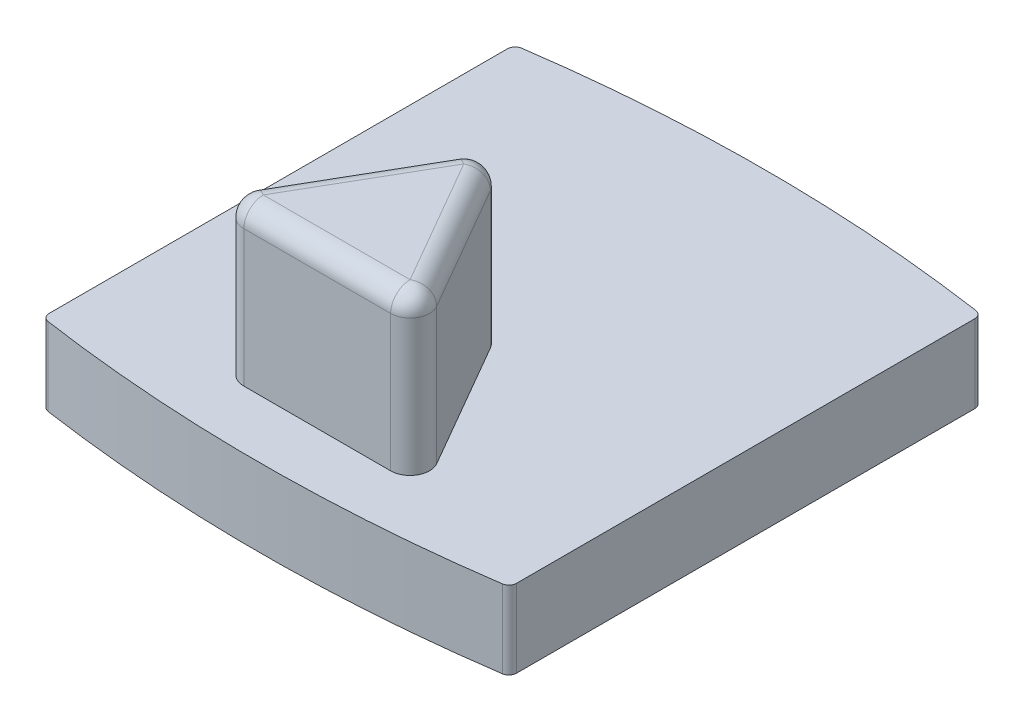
ISO-10303-21;
HEADER;
FILE_DESCRIPTION(('STEP AP214'),'2;1');
FILE_NAME('part.step','',(''),(''),'','','');
FILE_SCHEMA(('AUTOMOTIVE_DESIGN { 1 0 10303 214 1 1 1 1 }'));
ENDSEC;
DATA;
#1=APPLICATION_CONTEXT('core data for automotive mechanical design processes');
#2=APPLICATION_PROTOCOL_DEFINITION('international standard','automotive_design',2000,#1);
#3=PRODUCT_CONTEXT('',#1,'mechanical');
#4=PRODUCT('Part','Part','',(#3));
#5=PRODUCT_RELATED_PRODUCT_CATEGORY('part','',(#4));
#6=PRODUCT_DEFINITION_FORMATION('','',#4);
#7=PRODUCT_DEFINITION_CONTEXT('part definition',#1,'design');
#8=PRODUCT_DEFINITION('design','',#6,#7);
#9=PRODUCT_DEFINITION_SHAPE('','',#8);
#10=(LENGTH_UNIT() NAMED_UNIT(*) SI_UNIT(.MILLI.,.METRE.));
#11=(NAMED_UNIT(*) PLANE_ANGLE_UNIT() SI_UNIT($,.RADIAN.));
#12=(NAMED_UNIT(*) SI_UNIT($,.STERADIAN.) SOLID_ANGLE_UNIT());
#13=UNCERTAINTY_MEASURE_WITH_UNIT(LENGTH_MEASURE(1.E-05),#10,'distance_accuracy_value','');
#14=(GEOMETRIC_REPRESENTATION_CONTEXT(3) GLOBAL_UNCERTAINTY_ASSIGNED_CONTEXT((#13)) GLOBAL_UNIT_ASSIGNED_CONTEXT((#10,
#11,#12)) REPRESENTATION_CONTEXT('',''));
#15=CARTESIAN_POINT('',(0.,0.,0.));
#16=DIRECTION('',(0.,0.,1.));
#17=DIRECTION('',(1.,0.,0.));
#18=AXIS2_PLACEMENT_3D('',#15,#16,#17);
#19=CARTESIAN_POINT('',(0.,2.,0.));
#20=DIRECTION('',(0.,-1.,0.));
#21=DIRECTION('',(0.,0.,-1.));
#22=AXIS2_PLACEMENT_3D('',#19,#20,#21);
#23=PLANE('',#22);
#24=CARTESIAN_POINT('',(0.,2.,-34.));
#25=DIRECTION('',(0.,1.,0.));
#26=DIRECTION('',(0.,0.,1.));
#27=AXIS2_PLACEMENT_3D('',#24,#25,#26);
#28=CIRCLE('',#27,40.5);
#29=CARTESIAN_POINT('',(5.8287841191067,2.,6.07836418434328));
#30=VERTEX_POINT('',#29);
#31=CARTESIAN_POINT('',(-5.8287841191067,2.,6.07836418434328));
#32=VERTEX_POINT('',#31);
#33=EDGE_CURVE('E205',#30,#32,#28,.F.);
#34=ORIENTED_EDGE('',*,*,#33,.F.);
#35=CARTESIAN_POINT('',(5.8,2.,5.88044633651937));
#36=DIRECTION('',(0.,-1.,0.));
#37=DIRECTION('',(0.,0.,-1.));
#38=AXIS2_PLACEMENT_3D('',#35,#36,#37);
#39=CIRCLE('',#38,0.2);
#40=CARTESIAN_POINT('',(6.,2.,5.88044633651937));
#41=VERTEX_POINT('',#40);
#42=EDGE_CURVE('E329',#30,#41,#39,.F.);
#43=ORIENTED_EDGE('',*,*,#42,.T.);
#44=DIRECTION('',(0.,0.,-1.));
#45=VECTOR('',#44,1.);
#46=CARTESIAN_POINT('',(6.,2.,6.5));
#47=LINE('',#46,#45);
#48=CARTESIAN_POINT('',(6.,2.,-5.88044633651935));
#49=VERTEX_POINT('',#48);
#50=EDGE_CURVE('E217',#41,#49,#47,.T.);
#51=ORIENTED_EDGE('',*,*,#50,.T.);
#52=CARTESIAN_POINT('',(5.8,2.,-5.88044633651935));
#53=DIRECTION('',(0.,-1.,0.));
#54=DIRECTION('',(0.,0.,-1.));
#55=AXIS2_PLACEMENT_3D('',#52,#53,#54);
#56=CIRCLE('',#55,0.2);
#57=CARTESIAN_POINT('',(5.8287841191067,2.,-6.07836418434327));
#58=VERTEX_POINT('',#57);
#59=EDGE_CURVE('E71',#49,#58,#56,.F.);
#60=ORIENTED_EDGE('',*,*,#59,.T.);
#61=CARTESIAN_POINT('',(0.,2.,34.));
#62=DIRECTION('',(0.,1.,0.));
#63=DIRECTION('',(0.,0.,1.));
#64=AXIS2_PLACEMENT_3D('',#61,#62,#63);
#65=CIRCLE('',#64,40.5);
#66=CARTESIAN_POINT('',(-5.8287841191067,2.,-6.07836418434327));
#67=VERTEX_POINT('',#66);
#68=EDGE_CURVE('E213',#58,#67,#65,.T.);
#69=ORIENTED_EDGE('',*,*,#68,.T.);
#70=CARTESIAN_POINT('',(-5.8,2.,-5.88044633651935));
#71=DIRECTION('',(0.,-1.,0.));
#72=DIRECTION('',(0.,0.,-1.));
#73=AXIS2_PLACEMENT_3D('',#70,#71,#72);
#74=CIRCLE('',#73,0.2);
#75=CARTESIAN_POINT('',(-6.,2.,-5.88044633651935));
#76=VERTEX_POINT('',#75);
#77=EDGE_CURVE('E63',#67,#76,#74,.F.);
#78=ORIENTED_EDGE('',*,*,#77,.T.);
#79=DIRECTION('',(0.,0.,1.));
#80=VECTOR('',#79,1.);
#81=CARTESIAN_POINT('',(-6.,2.,6.5));
#82=LINE('',#81,#80);
#83=CARTESIAN_POINT('',(-6.,2.,5.88044633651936));
#84=VERTEX_POINT('',#83);
#85=EDGE_CURVE('E220',#76,#84,#82,.T.);
#86=ORIENTED_EDGE('',*,*,#85,.T.);
#87=CARTESIAN_POINT('',(-5.8,2.,5.88044633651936));
#88=DIRECTION('',(0.,-1.,0.));
#89=DIRECTION('',(0.,0.,-1.));
#90=AXIS2_PLACEMENT_3D('',#87,#88,#89);
#91=CIRCLE('',#90,0.2);
#92=EDGE_CURVE('E326',#84,#32,#91,.F.);
#93=ORIENTED_EDGE('',*,*,#92,.T.);
#94=EDGE_LOOP('',(#34,#43,#51,#60,#69,#78,#86,#93));
#95=FACE_BOUND('',#94,.T.);
#96=DIRECTION('',(-0.500000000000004,0.,0.866025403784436));
#97=VECTOR('',#96,1.);
#98=CARTESIAN_POINT('',(0.,2.,0.23686027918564));
#99=LINE('',#98,#97);
#100=CARTESIAN_POINT('',(-0.433012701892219,2.,0.98686027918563));
#101=VERTEX_POINT('',#100);
#102=CARTESIAN_POINT('',(-2.31698729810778,2.,4.25));
#103=VERTEX_POINT('',#102);
#104=EDGE_CURVE('E166',#101,#103,#99,.T.);
#105=ORIENTED_EDGE('',*,*,#104,.F.);
#106=CARTESIAN_POINT('',(0.,2.,1.23686027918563));
#107=DIRECTION('',(0.,-1.,0.));
#108=DIRECTION('',(0.,0.,-1.));
#109=AXIS2_PLACEMENT_3D('',#106,#107,#108);
#110=CIRCLE('',#109,0.5);
#111=CARTESIAN_POINT('',(0.433012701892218,2.,0.98686027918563));
#112=VERTEX_POINT('',#111);
#113=EDGE_CURVE('E177',#101,#112,#110,.T.);
#114=ORIENTED_EDGE('',*,*,#113,.T.);
#115=DIRECTION('',(-0.500000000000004,0.,-0.866025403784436));
#116=VECTOR('',#115,1.);
#117=CARTESIAN_POINT('',(2.75,2.,5.));
#118=LINE('',#117,#116);
#119=CARTESIAN_POINT('',(2.31698729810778,2.,4.25));
#120=VERTEX_POINT('',#119);
#121=EDGE_CURVE('E197',#120,#112,#118,.T.);
#122=ORIENTED_EDGE('',*,*,#121,.F.);
#123=CARTESIAN_POINT('',(1.88397459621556,2.,4.5));
#124=DIRECTION('',(0.,-1.,0.));
#125=DIRECTION('',(0.,0.,-1.));
#126=AXIS2_PLACEMENT_3D('',#123,#124,#125);
#127=CIRCLE('',#126,0.5);
#128=CARTESIAN_POINT('',(1.88397459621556,2.,5.));
#129=VERTEX_POINT('',#128);
#130=EDGE_CURVE('E249',#120,#129,#127,.T.);
#131=ORIENTED_EDGE('',*,*,#130,.T.);
#132=DIRECTION('',(1.,0.,0.));
#133=VECTOR('',#132,1.);
#134=CARTESIAN_POINT('',(-2.75,2.,5.));
#135=LINE('',#134,#133);
#136=CARTESIAN_POINT('',(-1.88397459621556,2.,5.));
#137=VERTEX_POINT('',#136);
#138=EDGE_CURVE('E191',#137,#129,#135,.T.);
#139=ORIENTED_EDGE('',*,*,#138,.F.);
#140=CARTESIAN_POINT('',(-1.88397459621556,2.,4.5));
#141=DIRECTION('',(0.,-1.,0.));
#142=DIRECTION('',(0.,0.,-1.));
#143=AXIS2_PLACEMENT_3D('',#140,#141,#142);
#144=CIRCLE('',#143,0.5);
#145=EDGE_CURVE('E185',#137,#103,#144,.T.);
#146=ORIENTED_EDGE('',*,*,#145,.T.);
#147=EDGE_LOOP('',(#105,#114,#122,#131,#139,#146));
#148=FACE_BOUND('',#147,.T.);
#149=ADVANCED_FACE('F47',(#95,#148),#23,.F.);
#150=CARTESIAN_POINT('',(0.,0.,0.));
#151=DIRECTION('',(0.,-1.,0.));
#152=DIRECTION('',(0.,0.,-1.));
#153=AXIS2_PLACEMENT_3D('',#150,#151,#152);
#154=PLANE('',#153);
#155=DIRECTION('',(0.,0.,-1.));
#156=VECTOR('',#155,1.);
#157=CARTESIAN_POINT('',(6.,0.,6.5));
#158=LINE('',#157,#156);
#159=CARTESIAN_POINT('',(6.,0.,5.88044633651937));
#160=VERTEX_POINT('',#159);
#161=CARTESIAN_POINT('',(6.,0.,-5.88044633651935));
#162=VERTEX_POINT('',#161);
#163=EDGE_CURVE('E216',#160,#162,#158,.T.);
#164=ORIENTED_EDGE('',*,*,#163,.F.);
#165=CARTESIAN_POINT('',(5.8,0.,5.88044633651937));
#166=DIRECTION('',(0.,-1.,0.));
#167=DIRECTION('',(0.,0.,-1.));
#168=AXIS2_PLACEMENT_3D('',#165,#166,#167);
#169=CIRCLE('',#168,0.2);
#170=CARTESIAN_POINT('',(5.8287841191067,0.,6.07836418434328));
#171=VERTEX_POINT('',#170);
#172=EDGE_CURVE('E313',#160,#171,#169,.T.);
#173=ORIENTED_EDGE('',*,*,#172,.T.);
#174=CARTESIAN_POINT('',(0.,0.,-34.));
#175=DIRECTION('',(0.,-1.,0.));
#176=DIRECTION('',(0.,0.,-1.));
#177=AXIS2_PLACEMENT_3D('',#174,#175,#176);
#178=CIRCLE('',#177,40.5);
#179=CARTESIAN_POINT('',(-5.8287841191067,0.,6.07836418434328));
#180=VERTEX_POINT('',#179);
#181=EDGE_CURVE('E209',#180,#171,#178,.F.);
#182=ORIENTED_EDGE('',*,*,#181,.F.);
#183=CARTESIAN_POINT('',(-5.8,0.,5.88044633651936));
#184=DIRECTION('',(0.,-1.,0.));
#185=DIRECTION('',(0.,0.,-1.));
#186=AXIS2_PLACEMENT_3D('',#183,#184,#185);
#187=CIRCLE('',#186,0.2);
#188=CARTESIAN_POINT('',(-6.,0.,5.88044633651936));
#189=VERTEX_POINT('',#188);
#190=EDGE_CURVE('E310',#180,#189,#187,.T.);
#191=ORIENTED_EDGE('',*,*,#190,.T.);
#192=DIRECTION('',(0.,0.,1.));
#193=VECTOR('',#192,1.);
#194=CARTESIAN_POINT('',(-6.,0.,6.5));
#195=LINE('',#194,#193);
#196=CARTESIAN_POINT('',(-6.,0.,-5.88044633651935));
#197=VERTEX_POINT('',#196);
#198=EDGE_CURVE('E221',#197,#189,#195,.T.);
#199=ORIENTED_EDGE('',*,*,#198,.F.);
#200=CARTESIAN_POINT('',(-5.8,0.,-5.88044633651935));
#201=DIRECTION('',(0.,-1.,0.));
#202=DIRECTION('',(0.,0.,-1.));
#203=AXIS2_PLACEMENT_3D('',#200,#201,#202);
#204=CIRCLE('',#203,0.2);
#205=CARTESIAN_POINT('',(-5.8287841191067,0.,-6.07836418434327));
#206=VERTEX_POINT('',#205);
#207=EDGE_CURVE('E304',#197,#206,#204,.T.);
#208=ORIENTED_EDGE('',*,*,#207,.T.);
#209=CARTESIAN_POINT('',(0.,0.,34.));
#210=DIRECTION('',(0.,-1.,0.));
#211=DIRECTION('',(0.,0.,-1.));
#212=AXIS2_PLACEMENT_3D('',#209,#210,#211);
#213=CIRCLE('',#212,40.5);
#214=CARTESIAN_POINT('',(5.8287841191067,0.,-6.07836418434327));
#215=VERTEX_POINT('',#214);
#216=EDGE_CURVE('E225',#206,#215,#213,.T.);
#217=ORIENTED_EDGE('',*,*,#216,.T.);
#218=CARTESIAN_POINT('',(5.8,0.,-5.88044633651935));
#219=DIRECTION('',(0.,-1.,0.));
#220=DIRECTION('',(0.,0.,-1.));
#221=AXIS2_PLACEMENT_3D('',#218,#219,#220);
#222=CIRCLE('',#221,0.2);
#223=EDGE_CURVE('E307',#215,#162,#222,.T.);
#224=ORIENTED_EDGE('',*,*,#223,.T.);
#225=EDGE_LOOP('',(#164,#173,#182,#191,#199,#208,#217,#224));
#226=FACE_BOUND('',#225,.T.);
#227=ADVANCED_FACE('F352',(#226),#154,.T.);
#228=CARTESIAN_POINT('',(6.,2.,6.5));
#229=DIRECTION('',(-1.,0.,0.));
#230=DIRECTION('',(0.,0.,1.));
#231=AXIS2_PLACEMENT_3D('',#228,#229,#230);
#232=PLANE('',#231);
#233=ORIENTED_EDGE('',*,*,#50,.F.);
#234=DIRECTION('',(0.,1.,0.));
#235=VECTOR('',#234,1.);
#236=CARTESIAN_POINT('',(6.,2.,5.88044633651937));
#237=LINE('',#236,#235);
#238=EDGE_CURVE('E300',#41,#160,#237,.F.);
#239=ORIENTED_EDGE('',*,*,#238,.T.);
#240=ORIENTED_EDGE('',*,*,#163,.T.);
#241=DIRECTION('',(0.,-1.,0.));
#242=VECTOR('',#241,1.);
#243=CARTESIAN_POINT('',(6.,2.,-5.88044633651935));
#244=LINE('',#243,#242);
#245=EDGE_CURVE('E280',#162,#49,#244,.F.);
#246=ORIENTED_EDGE('',*,*,#245,.T.);
#247=EDGE_LOOP('',(#233,#239,#240,#246));
#248=FACE_BOUND('',#247,.T.);
#249=ADVANCED_FACE('F367',(#248),#232,.F.);
#250=CARTESIAN_POINT('',(-6.,2.,6.5));
#251=DIRECTION('',(1.,0.,0.));
#252=DIRECTION('',(0.,0.,-1.));
#253=AXIS2_PLACEMENT_3D('',#250,#251,#252);
#254=PLANE('',#253);
#255=ORIENTED_EDGE('',*,*,#198,.T.);
#256=DIRECTION('',(0.,1.,0.));
#257=VECTOR('',#256,1.);
#258=CARTESIAN_POINT('',(-6.,2.,5.88044633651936));
#259=LINE('',#258,#257);
#260=EDGE_CURVE('E335',#189,#84,#259,.T.);
#261=ORIENTED_EDGE('',*,*,#260,.T.);
#262=ORIENTED_EDGE('',*,*,#85,.F.);
#263=DIRECTION('',(0.,-1.,0.));
#264=VECTOR('',#263,1.);
#265=CARTESIAN_POINT('',(-6.,0.,-5.88044633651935));
#266=LINE('',#265,#264);
#267=EDGE_CURVE('E332',#76,#197,#266,.T.);
#268=ORIENTED_EDGE('',*,*,#267,.T.);
#269=EDGE_LOOP('',(#255,#261,#262,#268));
#270=FACE_BOUND('',#269,.T.);
#271=ADVANCED_FACE('F347',(#270),#254,.F.);
#272=CARTESIAN_POINT('',(0.,-8.,34.));
#273=DIRECTION('',(0.,1.,0.));
#274=DIRECTION('',(0.,0.,1.));
#275=AXIS2_PLACEMENT_3D('',#272,#273,#274);
#276=CYLINDRICAL_SURFACE('',#275,40.5);
#277=ORIENTED_EDGE('',*,*,#68,.F.);
#278=DIRECTION('',(0.,1.,0.));
#279=VECTOR('',#278,1.);
#280=CARTESIAN_POINT('',(5.8287841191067,-8.,-6.07836418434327));
#281=LINE('',#280,#279);
#282=EDGE_CURVE('E11',#58,#215,#281,.F.);
#283=ORIENTED_EDGE('',*,*,#282,.T.);
#284=ORIENTED_EDGE('',*,*,#216,.F.);
#285=DIRECTION('',(0.,1.,0.));
#286=VECTOR('',#285,1.);
#287=CARTESIAN_POINT('',(-5.8287841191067,-8.,-6.07836418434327));
#288=LINE('',#287,#286);
#289=EDGE_CURVE('E56',#206,#67,#288,.T.);
#290=ORIENTED_EDGE('',*,*,#289,.T.);
#291=EDGE_LOOP('',(#277,#283,#284,#290));
#292=FACE_BOUND('',#291,.T.);
#293=ADVANCED_FACE('F341',(#292),#276,.T.);
#294=CARTESIAN_POINT('',(0.,-8.,-34.));
#295=DIRECTION('',(0.,1.,0.));
#296=DIRECTION('',(0.,0.,1.));
#297=AXIS2_PLACEMENT_3D('',#294,#295,#296);
#298=CYLINDRICAL_SURFACE('',#297,40.5);
#299=ORIENTED_EDGE('',*,*,#181,.T.);
#300=DIRECTION('',(0.,1.,0.));
#301=VECTOR('',#300,1.);
#302=CARTESIAN_POINT('',(5.8287841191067,-8.,6.07836418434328));
#303=LINE('',#302,#301);
#304=EDGE_CURVE('E319',#171,#30,#303,.T.);
#305=ORIENTED_EDGE('',*,*,#304,.T.);
#306=ORIENTED_EDGE('',*,*,#33,.T.);
#307=DIRECTION('',(0.,1.,0.));
#308=VECTOR('',#307,1.);
#309=CARTESIAN_POINT('',(-5.8287841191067,-8.,6.07836418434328));
#310=LINE('',#309,#308);
#311=EDGE_CURVE('E316',#32,#180,#310,.F.);
#312=ORIENTED_EDGE('',*,*,#311,.T.);
#313=EDGE_LOOP('',(#299,#305,#306,#312));
#314=FACE_BOUND('',#313,.T.);
#315=ADVANCED_FACE('F360',(#314),#298,.T.);
#316=CARTESIAN_POINT('',(0.,6.,0.23686027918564));
#317=DIRECTION('',(0.866025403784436,0.,0.500000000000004));
#318=DIRECTION('',(0.500000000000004,0.,-0.866025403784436));
#319=AXIS2_PLACEMENT_3D('',#316,#317,#318);
#320=PLANE('',#319);
#321=DIRECTION('',(0.,-1.,0.));
#322=VECTOR('',#321,1.);
#323=CARTESIAN_POINT('',(-2.31698729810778,6.,4.25));
#324=LINE('',#323,#322);
#325=CARTESIAN_POINT('',(-2.31698729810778,5.5,4.25));
#326=VERTEX_POINT('',#325);
#327=EDGE_CURVE('E174',#103,#326,#324,.F.);
#328=ORIENTED_EDGE('',*,*,#327,.T.);
#329=DIRECTION('',(-0.500000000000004,0.,0.866025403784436));
#330=VECTOR('',#329,1.);
#331=CARTESIAN_POINT('',(-0.433012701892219,5.5,0.98686027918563));
#332=LINE('',#331,#330);
#333=CARTESIAN_POINT('',(-0.433012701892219,5.5,0.98686027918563));
#334=VERTEX_POINT('',#333);
#335=EDGE_CURVE('E169',#326,#334,#332,.F.);
#336=ORIENTED_EDGE('',*,*,#335,.T.);
#337=DIRECTION('',(0.,-1.,0.));
#338=VECTOR('',#337,1.);
#339=CARTESIAN_POINT('',(-0.433012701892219,6.,0.98686027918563));
#340=LINE('',#339,#338);
#341=EDGE_CURVE('E161',#334,#101,#340,.T.);
#342=ORIENTED_EDGE('',*,*,#341,.T.);
#343=ORIENTED_EDGE('',*,*,#104,.T.);
#344=EDGE_LOOP('',(#328,#336,#342,#343));
#345=FACE_BOUND('',#344,.T.);
#346=ADVANCED_FACE('F164',(#345),#320,.F.);
#347=CARTESIAN_POINT('',(-2.75,6.,5.));
#348=DIRECTION('',(0.,0.,-1.));
#349=DIRECTION('',(-1.,0.,0.));
#350=AXIS2_PLACEMENT_3D('',#347,#348,#349);
#351=PLANE('',#350);
#352=DIRECTION('',(0.,-1.,0.));
#353=VECTOR('',#352,1.);
#354=CARTESIAN_POINT('',(1.88397459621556,6.,5.));
#355=LINE('',#354,#353);
#356=CARTESIAN_POINT('',(1.88397459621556,5.5,5.));
#357=VERTEX_POINT('',#356);
#358=EDGE_CURVE('E241',#129,#357,#355,.F.);
#359=ORIENTED_EDGE('',*,*,#358,.T.);
#360=DIRECTION('',(1.,0.,0.));
#361=VECTOR('',#360,1.);
#362=CARTESIAN_POINT('',(-1.88397459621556,5.5,5.));
#363=LINE('',#362,#361);
#364=CARTESIAN_POINT('',(-1.88397459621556,5.5,5.));
#365=VERTEX_POINT('',#364);
#366=EDGE_CURVE('E266',#357,#365,#363,.F.);
#367=ORIENTED_EDGE('',*,*,#366,.T.);
#368=DIRECTION('',(0.,-1.,0.));
#369=VECTOR('',#368,1.);
#370=CARTESIAN_POINT('',(-1.88397459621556,6.,5.));
#371=LINE('',#370,#369);
#372=EDGE_CURVE('E186',#365,#137,#371,.T.);
#373=ORIENTED_EDGE('',*,*,#372,.T.);
#374=ORIENTED_EDGE('',*,*,#138,.T.);
#375=EDGE_LOOP('',(#359,#367,#373,#374));
#376=FACE_BOUND('',#375,.T.);
#377=ADVANCED_FACE('F517',(#376),#351,.F.);
#378=CARTESIAN_POINT('',(2.75,6.,5.));
#379=DIRECTION('',(-0.866025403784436,0.,0.500000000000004));
#380=DIRECTION('',(0.500000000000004,0.,0.866025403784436));
#381=AXIS2_PLACEMENT_3D('',#378,#379,#380);
#382=PLANE('',#381);
#383=DIRECTION('',(0.,-1.,0.));
#384=VECTOR('',#383,1.);
#385=CARTESIAN_POINT('',(0.433012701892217,6.,0.986860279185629));
#386=LINE('',#385,#384);
#387=CARTESIAN_POINT('',(0.433012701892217,5.5,0.986860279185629));
#388=VERTEX_POINT('',#387);
#389=EDGE_CURVE('E180',#112,#388,#386,.F.);
#390=ORIENTED_EDGE('',*,*,#389,.T.);
#391=DIRECTION('',(-0.500000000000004,0.,-0.866025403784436));
#392=VECTOR('',#391,1.);
#393=CARTESIAN_POINT('',(2.31698729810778,5.5,4.25));
#394=LINE('',#393,#392);
#395=CARTESIAN_POINT('',(2.31698729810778,5.5,4.25));
#396=VERTEX_POINT('',#395);
#397=EDGE_CURVE('E277',#388,#396,#394,.F.);
#398=ORIENTED_EDGE('',*,*,#397,.T.);
#399=DIRECTION('',(0.,-1.,0.));
#400=VECTOR('',#399,1.);
#401=CARTESIAN_POINT('',(2.31698729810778,6.,4.25));
#402=LINE('',#401,#400);
#403=EDGE_CURVE('E173',#396,#120,#402,.T.);
#404=ORIENTED_EDGE('',*,*,#403,.T.);
#405=ORIENTED_EDGE('',*,*,#121,.T.);
#406=EDGE_LOOP('',(#390,#398,#404,#405));
#407=FACE_BOUND('',#406,.T.);
#408=ADVANCED_FACE('F508',(#407),#382,.F.);
#409=CARTESIAN_POINT('',(0.,6.,0.));
#410=DIRECTION('',(0.,1.,0.));
#411=DIRECTION('',(0.,0.,1.));
#412=AXIS2_PLACEMENT_3D('',#409,#410,#411);
#413=PLANE('',#412);
#414=DIRECTION('',(-0.500000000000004,0.,0.866025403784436));
#415=VECTOR('',#414,1.);
#416=CARTESIAN_POINT('',(-1.88397459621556,6.,4.5));
#417=LINE('',#416,#415);
#418=CARTESIAN_POINT('',(0.,6.,1.23686027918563));
#419=VERTEX_POINT('',#418);
#420=CARTESIAN_POINT('',(-1.88397459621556,6.,4.5));
#421=VERTEX_POINT('',#420);
#422=EDGE_CURVE('E259',#419,#421,#417,.T.);
#423=ORIENTED_EDGE('',*,*,#422,.T.);
#424=DIRECTION('',(1.,0.,0.));
#425=VECTOR('',#424,1.);
#426=CARTESIAN_POINT('',(1.88397459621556,6.,4.5));
#427=LINE('',#426,#425);
#428=CARTESIAN_POINT('',(1.88397459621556,6.,4.5));
#429=VERTEX_POINT('',#428);
#430=EDGE_CURVE('E262',#421,#429,#427,.T.);
#431=ORIENTED_EDGE('',*,*,#430,.T.);
#432=DIRECTION('',(-0.500000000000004,0.,-0.866025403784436));
#433=VECTOR('',#432,1.);
#434=CARTESIAN_POINT('',(0.,6.,1.23686027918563));
#435=LINE('',#434,#433);
#436=EDGE_CURVE('E256',#429,#419,#435,.T.);
#437=ORIENTED_EDGE('',*,*,#436,.T.);
#438=EDGE_LOOP('',(#423,#431,#437));
#439=FACE_BOUND('',#438,.T.);
#440=ADVANCED_FACE('F394',(#439),#413,.T.);
#441=CARTESIAN_POINT('',(0.,6.,1.23686027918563));
#442=DIRECTION('',(0.,-1.,0.));
#443=DIRECTION('',(0.,0.,-1.));
#444=AXIS2_PLACEMENT_3D('',#441,#442,#443);
#445=CYLINDRICAL_SURFACE('',#444,0.5);
#446=ORIENTED_EDGE('',*,*,#341,.F.);
#447=CARTESIAN_POINT('',(0.,5.5,1.23686027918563));
#448=DIRECTION('',(0.,-1.,0.));
#449=DIRECTION('',(0.,0.,-1.));
#450=AXIS2_PLACEMENT_3D('',#447,#448,#449);
#451=CIRCLE('',#450,0.5);
#452=EDGE_CURVE('E274',#334,#388,#451,.T.);
#453=ORIENTED_EDGE('',*,*,#452,.T.);
#454=ORIENTED_EDGE('',*,*,#389,.F.);
#455=ORIENTED_EDGE('',*,*,#113,.F.);
#456=EDGE_LOOP('',(#446,#453,#454,#455));
#457=FACE_BOUND('',#456,.T.);
#458=ADVANCED_FACE('F178',(#457),#445,.T.);
#459=CARTESIAN_POINT('',(-1.88397459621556,6.,4.5));
#460=DIRECTION('',(0.,-1.,0.));
#461=DIRECTION('',(0.,0.,-1.));
#462=AXIS2_PLACEMENT_3D('',#459,#460,#461);
#463=CYLINDRICAL_SURFACE('',#462,0.5);
#464=ORIENTED_EDGE('',*,*,#372,.F.);
#465=CARTESIAN_POINT('',(-1.88397459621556,5.5,4.5));
#466=DIRECTION('',(0.,-1.,0.));
#467=DIRECTION('',(0.,0.,-1.));
#468=AXIS2_PLACEMENT_3D('',#465,#466,#467);
#469=CIRCLE('',#468,0.5);
#470=EDGE_CURVE('E269',#365,#326,#469,.T.);
#471=ORIENTED_EDGE('',*,*,#470,.T.);
#472=ORIENTED_EDGE('',*,*,#327,.F.);
#473=ORIENTED_EDGE('',*,*,#145,.F.);
#474=EDGE_LOOP('',(#464,#471,#472,#473));
#475=FACE_BOUND('',#474,.T.);
#476=ADVANCED_FACE('F393',(#475),#463,.T.);
#477=CARTESIAN_POINT('',(1.88397459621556,6.,4.5));
#478=DIRECTION('',(0.,-1.,0.));
#479=DIRECTION('',(0.,0.,-1.));
#480=AXIS2_PLACEMENT_3D('',#477,#478,#479);
#481=CYLINDRICAL_SURFACE('',#480,0.5);
#482=ORIENTED_EDGE('',*,*,#403,.F.);
#483=CARTESIAN_POINT('',(1.88397459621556,5.5,4.5));
#484=DIRECTION('',(0.,-1.,0.));
#485=DIRECTION('',(0.,0.,-1.));
#486=AXIS2_PLACEMENT_3D('',#483,#484,#485);
#487=CIRCLE('',#486,0.5);
#488=EDGE_CURVE('E252',#396,#357,#487,.T.);
#489=ORIENTED_EDGE('',*,*,#488,.T.);
#490=ORIENTED_EDGE('',*,*,#358,.F.);
#491=ORIENTED_EDGE('',*,*,#130,.F.);
#492=EDGE_LOOP('',(#482,#489,#490,#491));
#493=FACE_BOUND('',#492,.T.);
#494=ADVANCED_FACE('F397',(#493),#481,.T.);
#495=CARTESIAN_POINT('',(0.535576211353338,5.5,0.309215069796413));
#496=DIRECTION('',(0.500000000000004,0.,-0.866025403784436));
#497=DIRECTION('',(-0.866025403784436,0.,-0.500000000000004));
#498=AXIS2_PLACEMENT_3D('',#495,#496,#497);
#499=CYLINDRICAL_SURFACE('',#498,0.5);
#500=CARTESIAN_POINT('',(0.,5.5,1.23686027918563));
#501=DIRECTION('',(0.500000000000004,0.,-0.866025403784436));
#502=DIRECTION('',(-0.866025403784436,0.,-0.500000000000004));
#503=AXIS2_PLACEMENT_3D('',#500,#501,#502);
#504=CIRCLE('',#503,0.5);
#505=EDGE_CURVE('E200',#334,#419,#504,.T.);
#506=ORIENTED_EDGE('',*,*,#505,.F.);
#507=ORIENTED_EDGE('',*,*,#335,.F.);
#508=CARTESIAN_POINT('',(-1.88397459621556,5.5,4.5));
#509=DIRECTION('',(-0.500000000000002,0.,0.866025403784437));
#510=DIRECTION('',(0.866025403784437,0.,0.500000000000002));
#511=AXIS2_PLACEMENT_3D('',#508,#509,#510);
#512=CIRCLE('',#511,0.5);
#513=EDGE_CURVE('E192',#421,#326,#512,.T.);
#514=ORIENTED_EDGE('',*,*,#513,.F.);
#515=ORIENTED_EDGE('',*,*,#422,.F.);
#516=EDGE_LOOP('',(#506,#507,#514,#515));
#517=FACE_BOUND('',#516,.T.);
#518=ADVANCED_FACE('F401',(#517),#499,.T.);
#519=CARTESIAN_POINT('',(-1.88397459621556,5.5,4.5));
#520=DIRECTION('',(0.,1.,0.));
#521=DIRECTION('',(0.,0.,1.));
#522=AXIS2_PLACEMENT_3D('',#519,#520,#521);
#523=SPHERICAL_SURFACE('',#522,0.5);
#524=ORIENTED_EDGE('',*,*,#513,.T.);
#525=ORIENTED_EDGE('',*,*,#470,.F.);
#526=CARTESIAN_POINT('',(-1.88397459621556,5.5,4.5));
#527=DIRECTION('',(1.,0.,0.));
#528=DIRECTION('',(0.,0.,-1.));
#529=AXIS2_PLACEMENT_3D('',#526,#527,#528);
#530=CIRCLE('',#529,0.5);
#531=EDGE_CURVE('E291',#421,#365,#530,.T.);
#532=ORIENTED_EDGE('',*,*,#531,.F.);
#533=EDGE_LOOP('',(#524,#525,#532));
#534=FACE_BOUND('',#533,.T.);
#535=ADVANCED_FACE('F417',(#534),#523,.T.);
#536=CARTESIAN_POINT('',(0.,5.5,1.23686027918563));
#537=DIRECTION('',(0.,1.,0.));
#538=DIRECTION('',(0.,0.,1.));
#539=AXIS2_PLACEMENT_3D('',#536,#537,#538);
#540=SPHERICAL_SURFACE('',#539,0.5);
#541=ORIENTED_EDGE('',*,*,#452,.F.);
#542=ORIENTED_EDGE('',*,*,#505,.T.);
#543=CARTESIAN_POINT('',(0.,5.5,1.23686027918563));
#544=DIRECTION('',(0.500000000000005,0.,0.866025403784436));
#545=DIRECTION('',(0.866025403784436,0.,-0.500000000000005));
#546=AXIS2_PLACEMENT_3D('',#543,#544,#545);
#547=CIRCLE('',#546,0.5);
#548=EDGE_CURVE('E287',#388,#419,#547,.T.);
#549=ORIENTED_EDGE('',*,*,#548,.F.);
#550=EDGE_LOOP('',(#541,#542,#549));
#551=FACE_BOUND('',#550,.T.);
#552=ADVANCED_FACE('F413',(#551),#540,.T.);
#553=CARTESIAN_POINT('',(0.,5.5,4.5));
#554=DIRECTION('',(-1.,0.,0.));
#555=DIRECTION('',(0.,0.,1.));
#556=AXIS2_PLACEMENT_3D('',#553,#554,#555);
#557=CYLINDRICAL_SURFACE('',#556,0.5);
#558=ORIENTED_EDGE('',*,*,#531,.T.);
#559=ORIENTED_EDGE('',*,*,#366,.F.);
#560=CARTESIAN_POINT('',(1.88397459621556,5.5,4.5));
#561=DIRECTION('',(1.,0.,0.));
#562=DIRECTION('',(0.,0.,-1.));
#563=AXIS2_PLACEMENT_3D('',#560,#561,#562);
#564=CIRCLE('',#563,0.5);
#565=EDGE_CURVE('E284',#429,#357,#564,.T.);
#566=ORIENTED_EDGE('',*,*,#565,.F.);
#567=ORIENTED_EDGE('',*,*,#430,.F.);
#568=EDGE_LOOP('',(#558,#559,#566,#567));
#569=FACE_BOUND('',#568,.T.);
#570=ADVANCED_FACE('F409',(#569),#557,.T.);
#571=CARTESIAN_POINT('',(-0.535576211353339,5.5,0.309215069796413));
#572=DIRECTION('',(0.500000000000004,0.,0.866025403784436));
#573=DIRECTION('',(0.866025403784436,0.,-0.500000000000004));
#574=AXIS2_PLACEMENT_3D('',#571,#572,#573);
#575=CYLINDRICAL_SURFACE('',#574,0.5);
#576=ORIENTED_EDGE('',*,*,#548,.T.);
#577=ORIENTED_EDGE('',*,*,#436,.F.);
#578=CARTESIAN_POINT('',(1.88397459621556,5.5,4.5));
#579=DIRECTION('',(0.500000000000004,0.,0.866025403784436));
#580=DIRECTION('',(0.866025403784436,0.,-0.500000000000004));
#581=AXIS2_PLACEMENT_3D('',#578,#579,#580);
#582=CIRCLE('',#581,0.5);
#583=EDGE_CURVE('E281',#396,#429,#582,.T.);
#584=ORIENTED_EDGE('',*,*,#583,.F.);
#585=ORIENTED_EDGE('',*,*,#397,.F.);
#586=EDGE_LOOP('',(#576,#577,#584,#585));
#587=FACE_BOUND('',#586,.T.);
#588=ADVANCED_FACE('F405',(#587),#575,.T.);
#589=CARTESIAN_POINT('',(1.88397459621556,5.5,4.5));
#590=DIRECTION('',(0.,1.,0.));
#591=DIRECTION('',(0.,0.,1.));
#592=AXIS2_PLACEMENT_3D('',#589,#590,#591);
#593=SPHERICAL_SURFACE('',#592,0.5);
#594=ORIENTED_EDGE('',*,*,#565,.T.);
#595=ORIENTED_EDGE('',*,*,#488,.F.);
#596=ORIENTED_EDGE('',*,*,#583,.T.);
#597=EDGE_LOOP('',(#594,#595,#596));
#598=FACE_BOUND('',#597,.T.);
#599=ADVANCED_FACE('F403',(#598),#593,.T.);
#600=CARTESIAN_POINT('',(5.8,-8.,5.88044633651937));
#601=DIRECTION('',(0.,1.,0.));
#602=DIRECTION('',(0.,0.,1.));
#603=AXIS2_PLACEMENT_3D('',#600,#601,#602);
#604=CYLINDRICAL_SURFACE('',#603,0.2);
#605=ORIENTED_EDGE('',*,*,#42,.F.);
#606=ORIENTED_EDGE('',*,*,#304,.F.);
#607=ORIENTED_EDGE('',*,*,#172,.F.);
#608=ORIENTED_EDGE('',*,*,#238,.F.);
#609=EDGE_LOOP('',(#605,#606,#607,#608));
#610=FACE_BOUND('',#609,.T.);
#611=ADVANCED_FACE('F363',(#610),#604,.T.);
#612=CARTESIAN_POINT('',(-5.8,-8.,5.88044633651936));
#613=DIRECTION('',(0.,1.,0.));
#614=DIRECTION('',(0.,0.,1.));
#615=AXIS2_PLACEMENT_3D('',#612,#613,#614);
#616=CYLINDRICAL_SURFACE('',#615,0.2);
#617=ORIENTED_EDGE('',*,*,#190,.F.);
#618=ORIENTED_EDGE('',*,*,#311,.F.);
#619=ORIENTED_EDGE('',*,*,#92,.F.);
#620=ORIENTED_EDGE('',*,*,#260,.F.);
#621=EDGE_LOOP('',(#617,#618,#619,#620));
#622=FACE_BOUND('',#621,.T.);
#623=ADVANCED_FACE('F356',(#622),#616,.T.);
#624=CARTESIAN_POINT('',(5.8,-8.,-5.88044633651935));
#625=DIRECTION('',(0.,1.,0.));
#626=DIRECTION('',(0.,0.,1.));
#627=AXIS2_PLACEMENT_3D('',#624,#625,#626);
#628=CYLINDRICAL_SURFACE('',#627,0.2);
#629=ORIENTED_EDGE('',*,*,#59,.F.);
#630=ORIENTED_EDGE('',*,*,#245,.F.);
#631=ORIENTED_EDGE('',*,*,#223,.F.);
#632=ORIENTED_EDGE('',*,*,#282,.F.);
#633=EDGE_LOOP('',(#629,#630,#631,#632));
#634=FACE_BOUND('',#633,.T.);
#635=ADVANCED_FACE('F370',(#634),#628,.T.);
#636=CARTESIAN_POINT('',(-5.8,-8.,-5.88044633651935));
#637=DIRECTION('',(0.,1.,0.));
#638=DIRECTION('',(0.,0.,1.));
#639=AXIS2_PLACEMENT_3D('',#636,#637,#638);
#640=CYLINDRICAL_SURFACE('',#639,0.2);
#641=ORIENTED_EDGE('',*,*,#207,.F.);
#642=ORIENTED_EDGE('',*,*,#267,.F.);
#643=ORIENTED_EDGE('',*,*,#77,.F.);
#644=ORIENTED_EDGE('',*,*,#289,.F.);
#645=EDGE_LOOP('',(#641,#642,#643,#644));
#646=FACE_BOUND('',#645,.T.);
#647=ADVANCED_FACE('F49',(#646),#640,.T.);
#648=CLOSED_SHELL('',(#149,#227,#249,#271,#293,#315,#346,#377,#408,#440,#458,#476,#494,#518,
#535,#552,#570,#588,#599,#611,#623,#635,#647));
#649=MANIFOLD_SOLID_BREP('B2',#648);
#650=ADVANCED_BREP_SHAPE_REPRESENTATION('',(#18,#649),#14);
#651=SHAPE_DEFINITION_REPRESENTATION(#9,#650);
ENDSEC;
END-ISO-10303-21;
